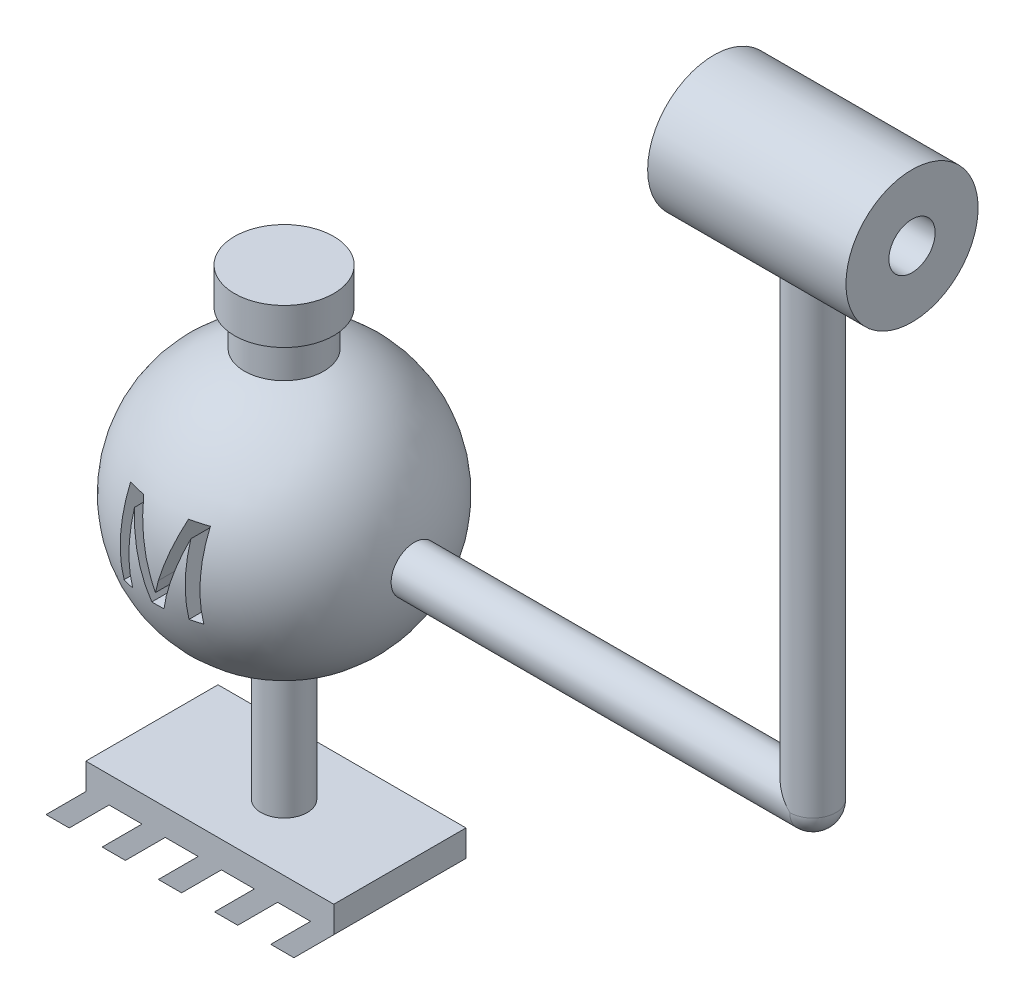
from build123d import *

# Parameters (mm, degrees)
ESQUISSE3_R             = 3.5
EXTRUSION1_DEPTH        = 80
ESQUISSE4_R             = 3.5
EXTRUSION2_DEPTH        = 80
ESQUISSE5_W             = 30
ESQUISSE5_H             = 10
ESQUISSE7_R             = 3.5
ENL_V_MAT_EXTRU_1_DEPTH = 35
ESQUISSE8_R             = 3.5
EXTRUSION3_DEPTH        = 40
ESQUISSE9_W             = 40
ESQUISSE9_H             = 20
EXTRUSION4_DEPTH        = 4
EXTRUSION5_DEPTH        = 20
ESQUISSE11_W            = 2.487115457
ESQUISSE11_H            = 4
ENL_V_MAT_EXTRU_2_DEPTH = 135.257215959
ENL_V_MAT_EXTRU_3_DEPTH = 73.45488577


with BuildPart() as part:
    # Esquisse2 → R_volution1 (revolve)
    with BuildSketch(Plane(origin=(0, 0, 0), x_dir=(0, 0, -1), z_dir=(1, 0, 0))):
        with BuildLine():
            Line((0, 30), (0, -20))
            ThreePointArc((0, -20), (-19.768354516, -3.035153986), (-6, 19.078784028))
            Line((-6, 19.078784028), (-6, 24.482933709))
            Line((-6, 24.482933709), (-7.5, 24.482933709))
            Line((-7.5, 24.482933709), (-7.5, 30))
            Line((-7.5, 30), (0, 30))
        make_face()
    revolve(axis=Axis((0, 50.24471086, 0), (0, -1, 0)))

    # Esquisse3 → Extrusion1 (add)
    with BuildSketch(Plane(origin=(0, 0, 0), x_dir=(0, 0, -1), z_dir=(1, 0, 0))):
        with Locations(Location((0, 0, 0), (0, 0, 180))):
            Circle(ESQUISSE3_R)
    extrude(amount=EXTRUSION1_DEPTH)

    # Esquisse4 → Extrusion2 (add)
    with BuildSketch(Plane(origin=(0, 0, 0), x_dir=(1, 0, 0), z_dir=(0, 1, 0))):
        with Locations(Location((80, 0, 0), (0, 0, 270))):
            Circle(ESQUISSE4_R)
    extrude(amount=EXTRUSION2_DEPTH)

    # Esquisse5 → R_volution2 (revolve)
    with BuildSketch(Plane.XY, mode=Mode.PRIVATE) as r_volution2_sk:
        with Locations((80, 75)):
            Rectangle(ESQUISSE5_W, ESQUISSE5_H)
    revolve(r_volution2_sk.sketch.rotate(Axis((80.192736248, 80, 0), (1, 0, 0)), 270), axis=Axis((80.192736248, 80, 0), (1, 0, 0)))

    # Esquisse6 → R_volution3 (revolve)
    with BuildSketch(Plane.XZ):
        with BuildLine():
            Line((80, 3.5), (80, -3.5))
            ThreePointArc((80, -3.5), (83.5, 0), (80, 3.5))
        make_face()
    revolve(axis=Axis((80, 0, 10.481140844), (0, 0, -1)))

    # Esquisse7 → Enl_v. mat.-Extru.1 (cut)
    with BuildSketch(Plane(origin=(95, 0, 0), x_dir=(0, 0, -1), z_dir=(1, 0, 0))):
        with Locations((0, 80)):
            Circle(ESQUISSE7_R)
    extrude(amount=-ENL_V_MAT_EXTRU_1_DEPTH, mode=Mode.SUBTRACT)

    # Esquisse8 → Extrusion3 (add)
    with BuildSketch(Plane(origin=(0, 0, 0), x_dir=(1, 0, 0), z_dir=(0, 1, 0))):
        with Locations(Location((0, 0, 0), (0, 0, 270))):
            Circle(ESQUISSE8_R)
    extrude(amount=-EXTRUSION3_DEPTH)

    # Esquisse9 → Extrusion4 (add)
    with BuildSketch(Plane.XZ.offset(40)):
        Rectangle(ESQUISSE9_W, ESQUISSE9_H)
    extrude(amount=EXTRUSION4_DEPTH)

    # Esquisse10 → Extrusion5 (add)
    with BuildSketch(Plane.XY.offset(10)):
        Polygon((-20, -44), (-26.025769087, -50.025769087), (-22.512884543, -50.025769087), (-16.487115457, -44), align=None)
        Polygon((-7.987115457, -44), (-11.5, -44), (-17.525769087, -50.025769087), (-14.012884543, -50.025769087), align=None)
        Polygon((0.512884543, -44), (-3, -44), (-9.025769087, -50.025769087), (-5.512884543, -50.025769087), align=None)
        Polygon((9.012884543, -44), (5.5, -44), (-0.525769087, -50.025769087), (2.987115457, -50.025769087), align=None)
        Polygon((17.512884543, -44), (14, -44), (7.974230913, -50.025769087), (11.487115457, -50.025769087), align=None)
    extrude(amount=-EXTRUSION5_DEPTH)

    # Esquisse11 → Enl_v. mat.-Extru.2 (cut, through all)
    with BuildSketch(Plane.XY.offset(10)):
        with Locations((18.756442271, -42)):
            Rectangle(ESQUISSE11_W, ESQUISSE11_H)
    extrude(amount=-ENL_V_MAT_EXTRU_2_DEPTH, mode=Mode.SUBTRACT)

    # Esquisse12 → Enl_v. mat.-Extru.3 (cut)
    with BuildSketch(Plane.XY):
        with BuildLine():
            Line((-5.596935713, -4.727139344), (-5.596935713, 7.600790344))
            Line((-5.596935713, 7.600790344), (-2.981695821, 7.600790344))
            Line((-2.981695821, 7.600790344), (-0.225692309, -1.049998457))
            add(Edge.make_bspline(
                [(-0.225692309, -1.049998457), (-0.195362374, -1.147996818), (-0.136706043, -1.337519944), (-0.049725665, -1.611208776), (0.029411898, -1.865541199), (0.100687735, -2.101326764), (0.167951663, -2.317394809), (0.226191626, -2.515518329), (0.281870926, -2.693495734), (0.314501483, -2.806606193), (0.32995356, -2.860169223)],
                knots=[0, 0, 0, 0, 1.300204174, 2.514519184, 3.639827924, 4.676153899, 5.636536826, 6.507959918, 7.293450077, 8, 8, 8, 8], degree=3))
            add(Edge.make_bspline(
                [(0.32995356, -2.860169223), (0.347163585, -2.801700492), (0.38378762, -2.677275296), (0.443161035, -2.481638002), (0.506336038, -2.265143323), (0.581937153, -2.031512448), (0.660742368, -1.777080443), (0.743458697, -1.502058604), (0.838870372, -1.209192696), (0.902276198, -1.006437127), (0.934990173, -0.901826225)],
                knots=[0, 0, 0, 0, 0.713638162, 1.518667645, 2.393860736, 3.354087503, 4.393659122, 5.512594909, 6.716633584, 8, 8, 8, 8], degree=3))
            Line((0.934990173, -0.901826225), (3.663828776, 7.600790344))
            Line((3.663828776, 7.600790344), (6.256842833, 7.600790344))
            Line((6.256842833, 7.600790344), (6.256842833, -4.727139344))
            Line((6.256842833, -4.727139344), (4.518288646, -4.727139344))
            Line((4.518288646, -4.727139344), (4.518288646, 5.704185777))
            Line((4.518288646, 5.704185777), (1.2288651, -4.727139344))
            Line((1.2288651, -4.727139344), (-0.588714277, -4.727139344))
            Line((-0.588714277, -4.727139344), (-3.858381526, 5.704185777))
            Line((-3.858381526, 5.704185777), (-3.858381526, -4.727139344))
            Line((-3.858381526, -4.727139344), (-5.596935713, -4.727139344))
        make_face()
    extrude(amount=ENL_V_MAT_EXTRU_3_DEPTH, mode=Mode.SUBTRACT)


solid = part.part
